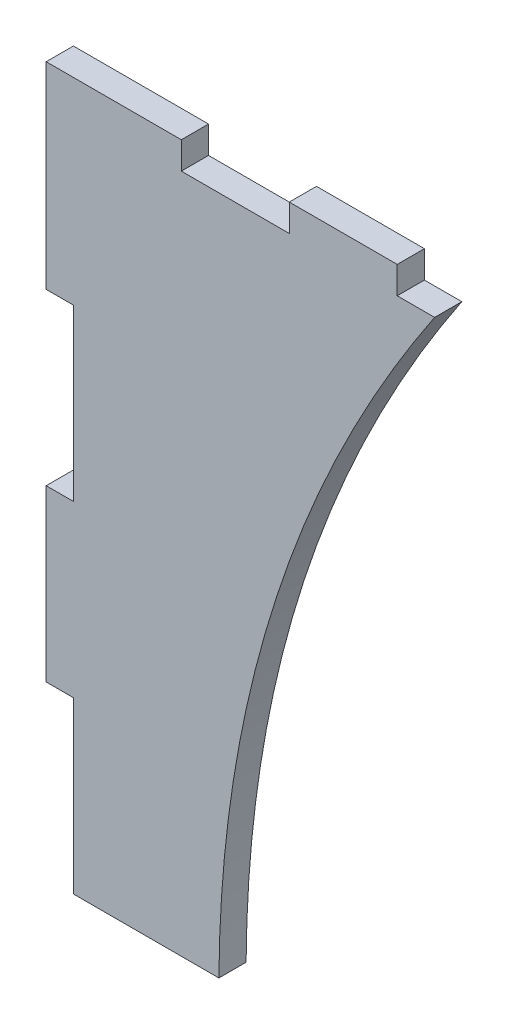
ISO-10303-21;
HEADER;
FILE_DESCRIPTION(('STEP AP214'),'2;1');
FILE_NAME('part.step','',(''),(''),'','','');
FILE_SCHEMA(('AUTOMOTIVE_DESIGN { 1 0 10303 214 1 1 1 1 }'));
ENDSEC;
DATA;
#1=APPLICATION_CONTEXT('core data for automotive mechanical design processes');
#2=APPLICATION_PROTOCOL_DEFINITION('international standard','automotive_design',2000,#1);
#3=PRODUCT_CONTEXT('',#1,'mechanical');
#4=PRODUCT('Part','Part','',(#3));
#5=PRODUCT_RELATED_PRODUCT_CATEGORY('part','',(#4));
#6=PRODUCT_DEFINITION_FORMATION('','',#4);
#7=PRODUCT_DEFINITION_CONTEXT('part definition',#1,'design');
#8=PRODUCT_DEFINITION('design','',#6,#7);
#9=PRODUCT_DEFINITION_SHAPE('','',#8);
#10=(LENGTH_UNIT() NAMED_UNIT(*) SI_UNIT(.MILLI.,.METRE.));
#11=(NAMED_UNIT(*) PLANE_ANGLE_UNIT() SI_UNIT($,.RADIAN.));
#12=(NAMED_UNIT(*) SI_UNIT($,.STERADIAN.) SOLID_ANGLE_UNIT());
#13=UNCERTAINTY_MEASURE_WITH_UNIT(LENGTH_MEASURE(1.E-05),#10,'distance_accuracy_value','');
#14=(GEOMETRIC_REPRESENTATION_CONTEXT(3) GLOBAL_UNCERTAINTY_ASSIGNED_CONTEXT((#13)) GLOBAL_UNIT_ASSIGNED_CONTEXT((#10,
#11,#12)) REPRESENTATION_CONTEXT('',''));
#15=CARTESIAN_POINT('',(0.,0.,0.));
#16=DIRECTION('',(0.,0.,1.));
#17=DIRECTION('',(1.,0.,0.));
#18=AXIS2_PLACEMENT_3D('',#15,#16,#17);
#19=CARTESIAN_POINT('',(0.,100.,16.));
#20=DIRECTION('',(0.,1.,0.));
#21=DIRECTION('',(0.,0.,1.));
#22=AXIS2_PLACEMENT_3D('',#19,#20,#21);
#23=PLANE('',#22);
#24=DIRECTION('',(1.,0.,0.));
#25=VECTOR('',#24,1.);
#26=CARTESIAN_POINT('',(0.,100.,0.));
#27=LINE('',#26,#25);
#28=CARTESIAN_POINT('',(0.,100.,0.));
#29=VERTEX_POINT('',#28);
#30=CARTESIAN_POINT('',(16.,100.,0.));
#31=VERTEX_POINT('',#30);
#32=EDGE_CURVE('E176',#29,#31,#27,.T.);
#33=ORIENTED_EDGE('',*,*,#32,.T.);
#34=DIRECTION('',(0.,0.,-1.));
#35=VECTOR('',#34,1.);
#36=CARTESIAN_POINT('',(16.,100.,16.));
#37=LINE('',#36,#35);
#38=CARTESIAN_POINT('',(16.,100.,16.));
#39=VERTEX_POINT('',#38);
#40=EDGE_CURVE('E11',#39,#31,#37,.T.);
#41=ORIENTED_EDGE('',*,*,#40,.F.);
#42=DIRECTION('',(1.,0.,0.));
#43=VECTOR('',#42,1.);
#44=CARTESIAN_POINT('',(0.,100.,16.));
#45=LINE('',#44,#43);
#46=CARTESIAN_POINT('',(0.,100.,16.));
#47=VERTEX_POINT('',#46);
#48=EDGE_CURVE('E213',#47,#39,#45,.T.);
#49=ORIENTED_EDGE('',*,*,#48,.F.);
#50=DIRECTION('',(0.,0.,-1.));
#51=VECTOR('',#50,1.);
#52=CARTESIAN_POINT('',(0.,100.,16.));
#53=LINE('',#52,#51);
#54=EDGE_CURVE('E172',#47,#29,#53,.T.);
#55=ORIENTED_EDGE('',*,*,#54,.T.);
#56=EDGE_LOOP('',(#33,#41,#49,#55));
#57=FACE_BOUND('',#56,.T.);
#58=ADVANCED_FACE('F32',(#57),#23,.F.);
#59=CARTESIAN_POINT('',(16.,100.,16.));
#60=DIRECTION('',(1.,0.,0.));
#61=DIRECTION('',(0.,0.,-1.));
#62=AXIS2_PLACEMENT_3D('',#59,#60,#61);
#63=PLANE('',#62);
#64=DIRECTION('',(0.,-1.,0.));
#65=VECTOR('',#64,1.);
#66=CARTESIAN_POINT('',(16.,100.,0.));
#67=LINE('',#66,#65);
#68=CARTESIAN_POINT('',(16.,0.,0.));
#69=VERTEX_POINT('',#68);
#70=EDGE_CURVE('E179',#31,#69,#67,.T.);
#71=ORIENTED_EDGE('',*,*,#70,.T.);
#72=DIRECTION('',(0.,0.,-1.));
#73=VECTOR('',#72,1.);
#74=CARTESIAN_POINT('',(16.,0.,16.));
#75=LINE('',#74,#73);
#76=CARTESIAN_POINT('',(16.,0.,16.));
#77=VERTEX_POINT('',#76);
#78=EDGE_CURVE('E40',#77,#69,#75,.T.);
#79=ORIENTED_EDGE('',*,*,#78,.F.);
#80=DIRECTION('',(0.,-1.,0.));
#81=VECTOR('',#80,1.);
#82=CARTESIAN_POINT('',(16.,100.,16.));
#83=LINE('',#82,#81);
#84=EDGE_CURVE('E115',#39,#77,#83,.T.);
#85=ORIENTED_EDGE('',*,*,#84,.F.);
#86=ORIENTED_EDGE('',*,*,#40,.T.);
#87=EDGE_LOOP('',(#71,#79,#85,#86));
#88=FACE_BOUND('',#87,.T.);
#89=ADVANCED_FACE('F313',(#88),#63,.F.);
#90=CARTESIAN_POINT('',(16.,0.,16.));
#91=DIRECTION('',(0.,1.,0.));
#92=DIRECTION('',(0.,0.,1.));
#93=AXIS2_PLACEMENT_3D('',#90,#91,#92);
#94=PLANE('',#93);
#95=DIRECTION('',(1.,0.,0.));
#96=VECTOR('',#95,1.);
#97=CARTESIAN_POINT('',(16.,0.,0.));
#98=LINE('',#97,#96);
#99=CARTESIAN_POINT('',(101.6,0.,0.));
#100=VERTEX_POINT('',#99);
#101=EDGE_CURVE('E181',#69,#100,#98,.T.);
#102=ORIENTED_EDGE('',*,*,#101,.T.);
#103=DIRECTION('',(0.,0.,-1.));
#104=VECTOR('',#103,1.);
#105=CARTESIAN_POINT('',(101.6,0.,16.));
#106=LINE('',#105,#104);
#107=CARTESIAN_POINT('',(101.6,0.,16.));
#108=VERTEX_POINT('',#107);
#109=EDGE_CURVE('E244',#108,#100,#106,.T.);
#110=ORIENTED_EDGE('',*,*,#109,.F.);
#111=DIRECTION('',(1.,0.,0.));
#112=VECTOR('',#111,1.);
#113=CARTESIAN_POINT('',(16.,0.,16.));
#114=LINE('',#113,#112);
#115=EDGE_CURVE('E252',#77,#108,#114,.T.);
#116=ORIENTED_EDGE('',*,*,#115,.F.);
#117=ORIENTED_EDGE('',*,*,#78,.T.);
#118=EDGE_LOOP('',(#102,#110,#116,#117));
#119=FACE_BOUND('',#118,.T.);
#120=ADVANCED_FACE('F250',(#119),#94,.F.);
#121=CARTESIAN_POINT('',(101.6,0.,16.));
#122=CARTESIAN_POINT('',(103.225203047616,213.725277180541,16.));
#123=CARTESIAN_POINT('',(228.5,400.,16.));
#124=B_SPLINE_CURVE_WITH_KNOTS('',2,(#121,#122,#123),.UNSPECIFIED.,.F.,.F.,(3,3),(0.,
0.978671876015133),.UNSPECIFIED.);
#125=DIRECTION('',(0.,0.,-1.));
#126=VECTOR('',#125,1.);
#127=SURFACE_OF_LINEAR_EXTRUSION('',#124,#126);
#128=CARTESIAN_POINT('',(101.6,0.,0.));
#129=CARTESIAN_POINT('',(103.225203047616,213.725277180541,0.));
#130=CARTESIAN_POINT('',(228.5,400.,0.));
#131=B_SPLINE_CURVE_WITH_KNOTS('',2,(#128,#129,#130),.UNSPECIFIED.,.F.,.F.,(3,3),(0.,
0.978671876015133),.UNSPECIFIED.);
#132=CARTESIAN_POINT('',(228.5,400.,0.));
#133=VERTEX_POINT('',#132);
#134=EDGE_CURVE('E183',#100,#133,#131,.T.);
#135=ORIENTED_EDGE('',*,*,#134,.T.);
#136=DIRECTION('',(0.,0.,-1.));
#137=VECTOR('',#136,1.);
#138=CARTESIAN_POINT('',(228.5,400.,16.));
#139=LINE('',#138,#137);
#140=CARTESIAN_POINT('',(228.5,400.,16.));
#141=VERTEX_POINT('',#140);
#142=EDGE_CURVE('E241',#141,#133,#139,.T.);
#143=ORIENTED_EDGE('',*,*,#142,.F.);
#144=EDGE_CURVE('E270',#108,#141,#124,.T.);
#145=ORIENTED_EDGE('',*,*,#144,.F.);
#146=ORIENTED_EDGE('',*,*,#109,.T.);
#147=EDGE_LOOP('',(#135,#143,#145,#146));
#148=FACE_BOUND('',#147,.T.);
#149=ADVANCED_FACE('F261',(#148),#127,.F.);
#150=CARTESIAN_POINT('',(206.5,400.,16.));
#151=DIRECTION('',(0.,-1.,0.));
#152=DIRECTION('',(0.,0.,-1.));
#153=AXIS2_PLACEMENT_3D('',#150,#151,#152);
#154=PLANE('',#153);
#155=DIRECTION('',(-1.,0.,0.));
#156=VECTOR('',#155,1.);
#157=CARTESIAN_POINT('',(206.5,400.,0.));
#158=LINE('',#157,#156);
#159=CARTESIAN_POINT('',(206.5,400.,0.));
#160=VERTEX_POINT('',#159);
#161=EDGE_CURVE('E187',#133,#160,#158,.T.);
#162=ORIENTED_EDGE('',*,*,#161,.T.);
#163=DIRECTION('',(0.,0.,-1.));
#164=VECTOR('',#163,1.);
#165=CARTESIAN_POINT('',(206.5,400.,16.));
#166=LINE('',#165,#164);
#167=CARTESIAN_POINT('',(206.5,400.,16.));
#168=VERTEX_POINT('',#167);
#169=EDGE_CURVE('E238',#168,#160,#166,.T.);
#170=ORIENTED_EDGE('',*,*,#169,.F.);
#171=DIRECTION('',(-1.,0.,0.));
#172=VECTOR('',#171,1.);
#173=CARTESIAN_POINT('',(206.5,400.,16.));
#174=LINE('',#173,#172);
#175=EDGE_CURVE('E267',#141,#168,#174,.T.);
#176=ORIENTED_EDGE('',*,*,#175,.F.);
#177=ORIENTED_EDGE('',*,*,#142,.T.);
#178=EDGE_LOOP('',(#162,#170,#176,#177));
#179=FACE_BOUND('',#178,.T.);
#180=ADVANCED_FACE('F265',(#179),#154,.F.);
#181=CARTESIAN_POINT('',(206.5,416.,16.));
#182=DIRECTION('',(-1.,0.,0.));
#183=DIRECTION('',(0.,-1.,0.));
#184=AXIS2_PLACEMENT_3D('',#181,#182,#183);
#185=PLANE('',#184);
#186=DIRECTION('',(0.,1.,0.));
#187=VECTOR('',#186,1.);
#188=CARTESIAN_POINT('',(206.5,416.,0.));
#189=LINE('',#188,#187);
#190=CARTESIAN_POINT('',(206.5,416.,0.));
#191=VERTEX_POINT('',#190);
#192=EDGE_CURVE('E192',#160,#191,#189,.T.);
#193=ORIENTED_EDGE('',*,*,#192,.T.);
#194=DIRECTION('',(0.,0.,-1.));
#195=VECTOR('',#194,1.);
#196=CARTESIAN_POINT('',(206.5,416.,16.));
#197=LINE('',#196,#195);
#198=CARTESIAN_POINT('',(206.5,416.,16.));
#199=VERTEX_POINT('',#198);
#200=EDGE_CURVE('E235',#199,#191,#197,.T.);
#201=ORIENTED_EDGE('',*,*,#200,.F.);
#202=DIRECTION('',(0.,1.,0.));
#203=VECTOR('',#202,1.);
#204=CARTESIAN_POINT('',(206.5,416.,16.));
#205=LINE('',#204,#203);
#206=EDGE_CURVE('E269',#168,#199,#205,.T.);
#207=ORIENTED_EDGE('',*,*,#206,.F.);
#208=ORIENTED_EDGE('',*,*,#169,.T.);
#209=EDGE_LOOP('',(#193,#201,#207,#208));
#210=FACE_BOUND('',#209,.T.);
#211=ADVANCED_FACE('F326',(#210),#185,.F.);
#212=CARTESIAN_POINT('',(206.5,416.,16.));
#213=DIRECTION('',(0.,-1.,0.));
#214=DIRECTION('',(0.,0.,-1.));
#215=AXIS2_PLACEMENT_3D('',#212,#213,#214);
#216=PLANE('',#215);
#217=DIRECTION('',(-1.,0.,0.));
#218=VECTOR('',#217,1.);
#219=CARTESIAN_POINT('',(206.5,416.,0.));
#220=LINE('',#219,#218);
#221=CARTESIAN_POINT('',(143.,416.,0.));
#222=VERTEX_POINT('',#221);
#223=EDGE_CURVE('E194',#191,#222,#220,.T.);
#224=ORIENTED_EDGE('',*,*,#223,.T.);
#225=DIRECTION('',(0.,0.,-1.));
#226=VECTOR('',#225,1.);
#227=CARTESIAN_POINT('',(143.,416.,16.));
#228=LINE('',#227,#226);
#229=CARTESIAN_POINT('',(143.,416.,16.));
#230=VERTEX_POINT('',#229);
#231=EDGE_CURVE('E232',#230,#222,#228,.T.);
#232=ORIENTED_EDGE('',*,*,#231,.F.);
#233=DIRECTION('',(-1.,0.,0.));
#234=VECTOR('',#233,1.);
#235=CARTESIAN_POINT('',(206.5,416.,16.));
#236=LINE('',#235,#234);
#237=EDGE_CURVE('E272',#199,#230,#236,.T.);
#238=ORIENTED_EDGE('',*,*,#237,.F.);
#239=ORIENTED_EDGE('',*,*,#200,.T.);
#240=EDGE_LOOP('',(#224,#232,#238,#239));
#241=FACE_BOUND('',#240,.T.);
#242=ADVANCED_FACE('F329',(#241),#216,.F.);
#243=CARTESIAN_POINT('',(143.,400.,16.));
#244=DIRECTION('',(1.,0.,0.));
#245=DIRECTION('',(0.,0.,-1.));
#246=AXIS2_PLACEMENT_3D('',#243,#244,#245);
#247=PLANE('',#246);
#248=DIRECTION('',(0.,-1.,0.));
#249=VECTOR('',#248,1.);
#250=CARTESIAN_POINT('',(143.,400.,0.));
#251=LINE('',#250,#249);
#252=CARTESIAN_POINT('',(143.,400.,0.));
#253=VERTEX_POINT('',#252);
#254=EDGE_CURVE('E196',#222,#253,#251,.T.);
#255=ORIENTED_EDGE('',*,*,#254,.T.);
#256=DIRECTION('',(0.,0.,-1.));
#257=VECTOR('',#256,1.);
#258=CARTESIAN_POINT('',(143.,400.,16.));
#259=LINE('',#258,#257);
#260=CARTESIAN_POINT('',(143.,400.,16.));
#261=VERTEX_POINT('',#260);
#262=EDGE_CURVE('E229',#261,#253,#259,.T.);
#263=ORIENTED_EDGE('',*,*,#262,.F.);
#264=DIRECTION('',(0.,-1.,0.));
#265=VECTOR('',#264,1.);
#266=CARTESIAN_POINT('',(143.,400.,16.));
#267=LINE('',#266,#265);
#268=EDGE_CURVE('E281',#230,#261,#267,.T.);
#269=ORIENTED_EDGE('',*,*,#268,.F.);
#270=ORIENTED_EDGE('',*,*,#231,.T.);
#271=EDGE_LOOP('',(#255,#263,#269,#270));
#272=FACE_BOUND('',#271,.T.);
#273=ADVANCED_FACE('F333',(#272),#247,.F.);
#274=CARTESIAN_POINT('',(143.,400.,16.));
#275=DIRECTION('',(0.,-1.,0.));
#276=DIRECTION('',(0.,0.,-1.));
#277=AXIS2_PLACEMENT_3D('',#274,#275,#276);
#278=PLANE('',#277);
#279=DIRECTION('',(-1.,0.,0.));
#280=VECTOR('',#279,1.);
#281=CARTESIAN_POINT('',(143.,400.,0.));
#282=LINE('',#281,#280);
#283=CARTESIAN_POINT('',(79.5,400.,0.));
#284=VERTEX_POINT('',#283);
#285=EDGE_CURVE('E198',#253,#284,#282,.T.);
#286=ORIENTED_EDGE('',*,*,#285,.T.);
#287=DIRECTION('',(0.,0.,-1.));
#288=VECTOR('',#287,1.);
#289=CARTESIAN_POINT('',(79.5,400.,16.));
#290=LINE('',#289,#288);
#291=CARTESIAN_POINT('',(79.5,400.,16.));
#292=VERTEX_POINT('',#291);
#293=EDGE_CURVE('E226',#292,#284,#290,.T.);
#294=ORIENTED_EDGE('',*,*,#293,.F.);
#295=DIRECTION('',(-1.,0.,0.));
#296=VECTOR('',#295,1.);
#297=CARTESIAN_POINT('',(143.,400.,16.));
#298=LINE('',#297,#296);
#299=EDGE_CURVE('E283',#261,#292,#298,.T.);
#300=ORIENTED_EDGE('',*,*,#299,.F.);
#301=ORIENTED_EDGE('',*,*,#262,.T.);
#302=EDGE_LOOP('',(#286,#294,#300,#301));
#303=FACE_BOUND('',#302,.T.);
#304=ADVANCED_FACE('F337',(#303),#278,.F.);
#305=CARTESIAN_POINT('',(79.5,416.,16.));
#306=DIRECTION('',(-1.,0.,0.));
#307=DIRECTION('',(0.,0.,1.));
#308=AXIS2_PLACEMENT_3D('',#305,#306,#307);
#309=PLANE('',#308);
#310=DIRECTION('',(0.,1.,0.));
#311=VECTOR('',#310,1.);
#312=CARTESIAN_POINT('',(79.5,416.,0.));
#313=LINE('',#312,#311);
#314=CARTESIAN_POINT('',(79.5,416.,0.));
#315=VERTEX_POINT('',#314);
#316=EDGE_CURVE('E200',#284,#315,#313,.T.);
#317=ORIENTED_EDGE('',*,*,#316,.T.);
#318=DIRECTION('',(0.,0.,-1.));
#319=VECTOR('',#318,1.);
#320=CARTESIAN_POINT('',(79.5,416.,16.));
#321=LINE('',#320,#319);
#322=CARTESIAN_POINT('',(79.5,416.,16.));
#323=VERTEX_POINT('',#322);
#324=EDGE_CURVE('E223',#323,#315,#321,.T.);
#325=ORIENTED_EDGE('',*,*,#324,.F.);
#326=DIRECTION('',(0.,1.,0.));
#327=VECTOR('',#326,1.);
#328=CARTESIAN_POINT('',(79.5,416.,16.));
#329=LINE('',#328,#327);
#330=EDGE_CURVE('E285',#292,#323,#329,.T.);
#331=ORIENTED_EDGE('',*,*,#330,.F.);
#332=ORIENTED_EDGE('',*,*,#293,.T.);
#333=EDGE_LOOP('',(#317,#325,#331,#332));
#334=FACE_BOUND('',#333,.T.);
#335=ADVANCED_FACE('F341',(#334),#309,.F.);
#336=CARTESIAN_POINT('',(0.,416.,16.));
#337=DIRECTION('',(0.,-1.,0.));
#338=DIRECTION('',(0.,0.,-1.));
#339=AXIS2_PLACEMENT_3D('',#336,#337,#338);
#340=PLANE('',#339);
#341=DIRECTION('',(-1.,0.,0.));
#342=VECTOR('',#341,1.);
#343=CARTESIAN_POINT('',(0.,416.,0.));
#344=LINE('',#343,#342);
#345=CARTESIAN_POINT('',(0.,416.,0.));
#346=VERTEX_POINT('',#345);
#347=EDGE_CURVE('E203',#315,#346,#344,.T.);
#348=ORIENTED_EDGE('',*,*,#347,.T.);
#349=DIRECTION('',(0.,0.,-1.));
#350=VECTOR('',#349,1.);
#351=CARTESIAN_POINT('',(0.,416.,16.));
#352=LINE('',#351,#350);
#353=CARTESIAN_POINT('',(0.,416.,16.));
#354=VERTEX_POINT('',#353);
#355=EDGE_CURVE('E220',#354,#346,#352,.T.);
#356=ORIENTED_EDGE('',*,*,#355,.F.);
#357=DIRECTION('',(-1.,0.,0.));
#358=VECTOR('',#357,1.);
#359=CARTESIAN_POINT('',(79.5,416.,16.));
#360=LINE('',#359,#358);
#361=EDGE_CURVE('E287',#323,#354,#360,.T.);
#362=ORIENTED_EDGE('',*,*,#361,.F.);
#363=ORIENTED_EDGE('',*,*,#324,.T.);
#364=EDGE_LOOP('',(#348,#356,#362,#363));
#365=FACE_BOUND('',#364,.T.);
#366=ADVANCED_FACE('F345',(#365),#340,.F.);
#367=CARTESIAN_POINT('',(0.,300.,16.));
#368=DIRECTION('',(1.,0.,0.));
#369=DIRECTION('',(0.,1.,0.));
#370=AXIS2_PLACEMENT_3D('',#367,#368,#369);
#371=PLANE('',#370);
#372=DIRECTION('',(0.,-1.,0.));
#373=VECTOR('',#372,1.);
#374=CARTESIAN_POINT('',(0.,300.,0.));
#375=LINE('',#374,#373);
#376=CARTESIAN_POINT('',(0.,300.,0.));
#377=VERTEX_POINT('',#376);
#378=EDGE_CURVE('E206',#346,#377,#375,.T.);
#379=ORIENTED_EDGE('',*,*,#378,.T.);
#380=DIRECTION('',(0.,0.,-1.));
#381=VECTOR('',#380,1.);
#382=CARTESIAN_POINT('',(0.,300.,16.));
#383=LINE('',#382,#381);
#384=CARTESIAN_POINT('',(0.,300.,16.));
#385=VERTEX_POINT('',#384);
#386=EDGE_CURVE('E217',#385,#377,#383,.T.);
#387=ORIENTED_EDGE('',*,*,#386,.F.);
#388=DIRECTION('',(0.,-1.,0.));
#389=VECTOR('',#388,1.);
#390=CARTESIAN_POINT('',(0.,400.,16.));
#391=LINE('',#390,#389);
#392=EDGE_CURVE('E289',#354,#385,#391,.T.);
#393=ORIENTED_EDGE('',*,*,#392,.F.);
#394=ORIENTED_EDGE('',*,*,#355,.T.);
#395=EDGE_LOOP('',(#379,#387,#393,#394));
#396=FACE_BOUND('',#395,.T.);
#397=ADVANCED_FACE('F295',(#396),#371,.F.);
#398=CARTESIAN_POINT('',(0.,300.,16.));
#399=DIRECTION('',(0.,1.,0.));
#400=DIRECTION('',(0.,0.,1.));
#401=AXIS2_PLACEMENT_3D('',#398,#399,#400);
#402=PLANE('',#401);
#403=DIRECTION('',(1.,0.,0.));
#404=VECTOR('',#403,1.);
#405=CARTESIAN_POINT('',(0.,300.,0.));
#406=LINE('',#405,#404);
#407=CARTESIAN_POINT('',(16.,300.,0.));
#408=VERTEX_POINT('',#407);
#409=EDGE_CURVE('E208',#377,#408,#406,.T.);
#410=ORIENTED_EDGE('',*,*,#409,.T.);
#411=DIRECTION('',(0.,0.,-1.));
#412=VECTOR('',#411,1.);
#413=CARTESIAN_POINT('',(16.,300.,16.));
#414=LINE('',#413,#412);
#415=CARTESIAN_POINT('',(16.,300.,16.));
#416=VERTEX_POINT('',#415);
#417=EDGE_CURVE('E167',#416,#408,#414,.T.);
#418=ORIENTED_EDGE('',*,*,#417,.F.);
#419=DIRECTION('',(1.,0.,0.));
#420=VECTOR('',#419,1.);
#421=CARTESIAN_POINT('',(0.,300.,16.));
#422=LINE('',#421,#420);
#423=EDGE_CURVE('E158',#385,#416,#422,.T.);
#424=ORIENTED_EDGE('',*,*,#423,.F.);
#425=ORIENTED_EDGE('',*,*,#386,.T.);
#426=EDGE_LOOP('',(#410,#418,#424,#425));
#427=FACE_BOUND('',#426,.T.);
#428=ADVANCED_FACE('F298',(#427),#402,.F.);
#429=CARTESIAN_POINT('',(16.,300.,16.));
#430=DIRECTION('',(1.,0.,0.));
#431=DIRECTION('',(0.,0.,-1.));
#432=AXIS2_PLACEMENT_3D('',#429,#430,#431);
#433=PLANE('',#432);
#434=DIRECTION('',(0.,-1.,0.));
#435=VECTOR('',#434,1.);
#436=CARTESIAN_POINT('',(16.,300.,0.));
#437=LINE('',#436,#435);
#438=CARTESIAN_POINT('',(16.,200.,0.));
#439=VERTEX_POINT('',#438);
#440=EDGE_CURVE('E166',#408,#439,#437,.T.);
#441=ORIENTED_EDGE('',*,*,#440,.T.);
#442=DIRECTION('',(0.,0.,-1.));
#443=VECTOR('',#442,1.);
#444=CARTESIAN_POINT('',(16.,200.,16.));
#445=LINE('',#444,#443);
#446=CARTESIAN_POINT('',(16.,200.,16.));
#447=VERTEX_POINT('',#446);
#448=EDGE_CURVE('E163',#447,#439,#445,.T.);
#449=ORIENTED_EDGE('',*,*,#448,.F.);
#450=DIRECTION('',(0.,-1.,0.));
#451=VECTOR('',#450,1.);
#452=CARTESIAN_POINT('',(16.,300.,16.));
#453=LINE('',#452,#451);
#454=EDGE_CURVE('E152',#416,#447,#453,.T.);
#455=ORIENTED_EDGE('',*,*,#454,.F.);
#456=ORIENTED_EDGE('',*,*,#417,.T.);
#457=EDGE_LOOP('',(#441,#449,#455,#456));
#458=FACE_BOUND('',#457,.T.);
#459=ADVANCED_FACE('F164',(#458),#433,.F.);
#460=CARTESIAN_POINT('',(16.,200.,16.));
#461=DIRECTION('',(0.,-1.,0.));
#462=DIRECTION('',(1.,0.,0.));
#463=AXIS2_PLACEMENT_3D('',#460,#461,#462);
#464=PLANE('',#463);
#465=DIRECTION('',(-1.,0.,0.));
#466=VECTOR('',#465,1.);
#467=CARTESIAN_POINT('',(16.,200.,0.));
#468=LINE('',#467,#466);
#469=CARTESIAN_POINT('',(0.,200.,0.));
#470=VERTEX_POINT('',#469);
#471=EDGE_CURVE('E101',#439,#470,#468,.T.);
#472=ORIENTED_EDGE('',*,*,#471,.T.);
#473=DIRECTION('',(0.,0.,-1.));
#474=VECTOR('',#473,1.);
#475=CARTESIAN_POINT('',(0.,200.,16.));
#476=LINE('',#475,#474);
#477=CARTESIAN_POINT('',(0.,200.,16.));
#478=VERTEX_POINT('',#477);
#479=EDGE_CURVE('E168',#478,#470,#476,.T.);
#480=ORIENTED_EDGE('',*,*,#479,.F.);
#481=DIRECTION('',(-1.,0.,0.));
#482=VECTOR('',#481,1.);
#483=CARTESIAN_POINT('',(16.,200.,16.));
#484=LINE('',#483,#482);
#485=EDGE_CURVE('E156',#447,#478,#484,.T.);
#486=ORIENTED_EDGE('',*,*,#485,.F.);
#487=ORIENTED_EDGE('',*,*,#448,.T.);
#488=EDGE_LOOP('',(#472,#480,#486,#487));
#489=FACE_BOUND('',#488,.T.);
#490=ADVANCED_FACE('F170',(#489),#464,.F.);
#491=CARTESIAN_POINT('',(0.,200.,16.));
#492=DIRECTION('',(1.,0.,0.));
#493=DIRECTION('',(0.,1.,0.));
#494=AXIS2_PLACEMENT_3D('',#491,#492,#493);
#495=PLANE('',#494);
#496=DIRECTION('',(0.,-1.,0.));
#497=VECTOR('',#496,1.);
#498=CARTESIAN_POINT('',(0.,200.,0.));
#499=LINE('',#498,#497);
#500=EDGE_CURVE('E107',#470,#29,#499,.T.);
#501=ORIENTED_EDGE('',*,*,#500,.T.);
#502=ORIENTED_EDGE('',*,*,#54,.F.);
#503=DIRECTION('',(0.,-1.,0.));
#504=VECTOR('',#503,1.);
#505=CARTESIAN_POINT('',(0.,200.,16.));
#506=LINE('',#505,#504);
#507=EDGE_CURVE('E48',#478,#47,#506,.T.);
#508=ORIENTED_EDGE('',*,*,#507,.F.);
#509=ORIENTED_EDGE('',*,*,#479,.T.);
#510=EDGE_LOOP('',(#501,#502,#508,#509));
#511=FACE_BOUND('',#510,.T.);
#512=ADVANCED_FACE('F302',(#511),#495,.F.);
#513=CARTESIAN_POINT('',(134.137601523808,206.862638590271,16.));
#514=DIRECTION('',(0.,0.,-1.));
#515=DIRECTION('',(-1.,0.,0.));
#516=AXIS2_PLACEMENT_3D('',#513,#514,#515);
#517=PLANE('',#516);
#518=ORIENTED_EDGE('',*,*,#48,.T.);
#519=ORIENTED_EDGE('',*,*,#84,.T.);
#520=ORIENTED_EDGE('',*,*,#115,.T.);
#521=ORIENTED_EDGE('',*,*,#144,.T.);
#522=ORIENTED_EDGE('',*,*,#175,.T.);
#523=ORIENTED_EDGE('',*,*,#206,.T.);
#524=ORIENTED_EDGE('',*,*,#237,.T.);
#525=ORIENTED_EDGE('',*,*,#268,.T.);
#526=ORIENTED_EDGE('',*,*,#299,.T.);
#527=ORIENTED_EDGE('',*,*,#330,.T.);
#528=ORIENTED_EDGE('',*,*,#361,.T.);
#529=ORIENTED_EDGE('',*,*,#392,.T.);
#530=ORIENTED_EDGE('',*,*,#423,.T.);
#531=ORIENTED_EDGE('',*,*,#454,.T.);
#532=ORIENTED_EDGE('',*,*,#485,.T.);
#533=ORIENTED_EDGE('',*,*,#507,.T.);
#534=EDGE_LOOP('',(#518,#519,#520,#521,#522,#523,#524,#525,#526,#527,#528,#529,#530,#531,#532,#533));
#535=FACE_BOUND('',#534,.T.);
#536=ADVANCED_FACE('F154',(#535),#517,.F.);
#537=CARTESIAN_POINT('',(134.137601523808,206.862638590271,0.));
#538=DIRECTION('',(0.,0.,-1.));
#539=DIRECTION('',(-1.,0.,0.));
#540=AXIS2_PLACEMENT_3D('',#537,#538,#539);
#541=PLANE('',#540);
#542=ORIENTED_EDGE('',*,*,#32,.F.);
#543=ORIENTED_EDGE('',*,*,#500,.F.);
#544=ORIENTED_EDGE('',*,*,#471,.F.);
#545=ORIENTED_EDGE('',*,*,#440,.F.);
#546=ORIENTED_EDGE('',*,*,#409,.F.);
#547=ORIENTED_EDGE('',*,*,#378,.F.);
#548=ORIENTED_EDGE('',*,*,#347,.F.);
#549=ORIENTED_EDGE('',*,*,#316,.F.);
#550=ORIENTED_EDGE('',*,*,#285,.F.);
#551=ORIENTED_EDGE('',*,*,#254,.F.);
#552=ORIENTED_EDGE('',*,*,#223,.F.);
#553=ORIENTED_EDGE('',*,*,#192,.F.);
#554=ORIENTED_EDGE('',*,*,#161,.F.);
#555=ORIENTED_EDGE('',*,*,#134,.F.);
#556=ORIENTED_EDGE('',*,*,#101,.F.);
#557=ORIENTED_EDGE('',*,*,#70,.F.);
#558=EDGE_LOOP('',(#542,#543,#544,#545,#546,#547,#548,#549,#550,#551,#552,#553,#554,#555,#556,#557));
#559=FACE_BOUND('',#558,.T.);
#560=ADVANCED_FACE('F256',(#559),#541,.T.);
#561=CLOSED_SHELL('',(#58,#89,#120,#149,#180,#211,#242,#273,#304,#335,#366,#397,#428,#459,#490,
#512,#536,#560));
#562=MANIFOLD_SOLID_BREP('B2',#561);
#563=ADVANCED_BREP_SHAPE_REPRESENTATION('',(#18,#562),#14);
#564=SHAPE_DEFINITION_REPRESENTATION(#9,#563);
ENDSEC;
END-ISO-10303-21;
